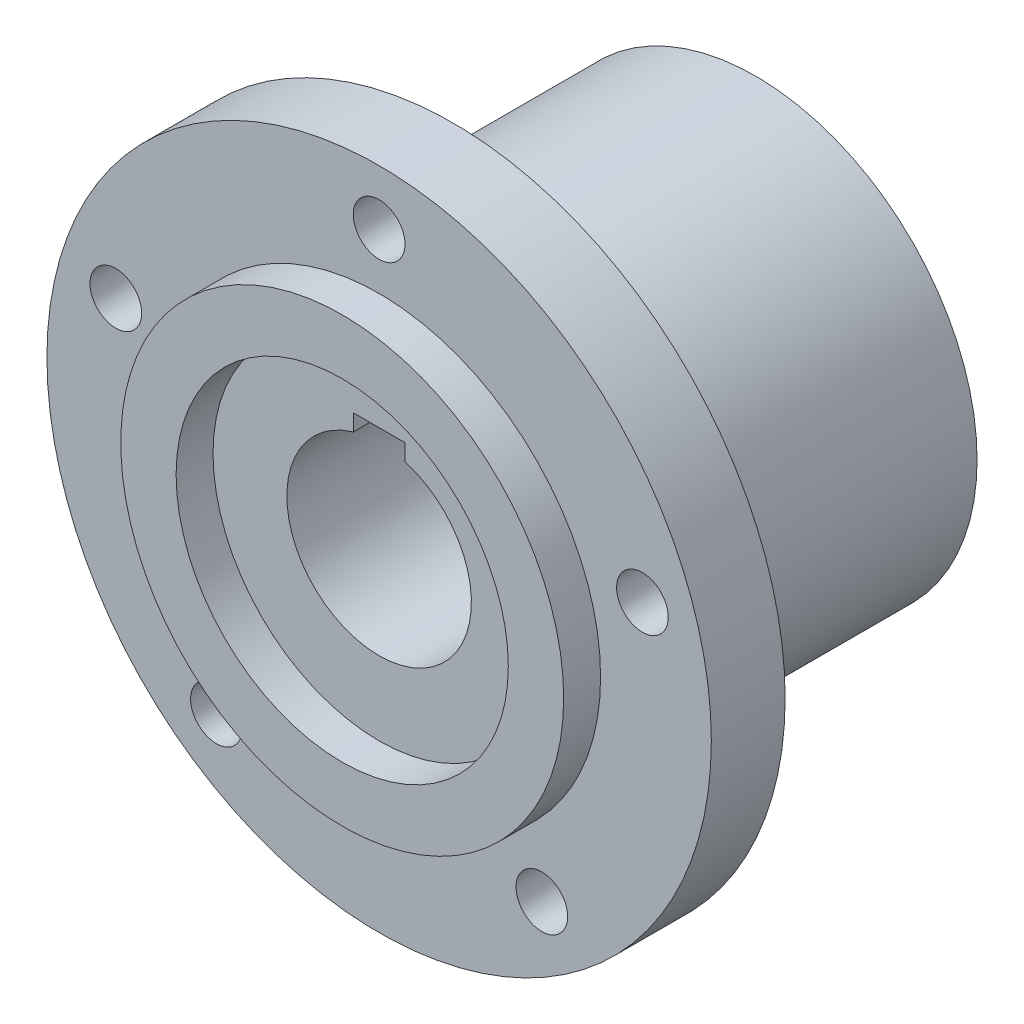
from build123d import *

# Parameters (mm, degrees)
ESQUISSE1_R                  = 60
EXTRUSION1_DEPTH             = 51
ENL_V_MAT_EXTRU_1_DEPTH      = 133.680066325
ESQUISSE3_R                  = 90
ESQUISSE3_R_2                = 60
EXTRUSION2_DEPTH             = 20
TROU_TARAUD_M16X2_D          = 14
R_P_TITION_CIRCULAIRE1_COUNT = 5
EXTRUSION3_START             = 10
ESQUISSE8_R                  = 60
ESQUISSE8_R_2                = 45
EXTRUSION3_DEPTH             = 10


with BuildPart() as part:
    # Esquisse1 → Extrusion1 (new, symmetric)
    with BuildSketch(Plane.XY):
        Circle(ESQUISSE1_R)
    extrude(amount=EXTRUSION1_DEPTH, both=True)

    # Esquisse2 → Enl_v. mat.-Extru.1 (cut, through all)
    with BuildSketch(Plane.XY.offset(51)):
        with BuildLine():
            Line((7, 28.5), (-7, 28.5))
            Line((-7, 28.5), (-7, 24))
            ThreePointArc((-7, 24), (0, -25), (7, 24))
            Line((7, 24), (7, 28.5))
        make_face()
    extrude(amount=-ENL_V_MAT_EXTRU_1_DEPTH, mode=Mode.SUBTRACT)

    # Esquisse3 → Extrusion2 (add)
    with BuildSketch(Plane.XY.offset(51)):
        Circle(ESQUISSE3_R)
        Circle(ESQUISSE3_R_2, mode=Mode.SUBTRACT)
    extrude(amount=-EXTRUSION2_DEPTH)

    # Trou taraud_ M16x2 (through all)
    with Locations(Plane.XY.offset(51)):
        with Locations((0, 75)):
            trou_taraud_m16x2 = Hole(TROU_TARAUD_M16X2_D / 2)

    # R_p_tition circulaire1: Trou taraud_ M16x2 ×5 about axis
    r_p_tition_circulaire1_axis = Axis((0, 0, 0), (0, 0, 1))
    for i in range(1, R_P_TITION_CIRCULAIRE1_COUNT):
        add(trou_taraud_m16x2.rotate(r_p_tition_circulaire1_axis, i * 360 / R_P_TITION_CIRCULAIRE1_COUNT), mode=Mode.SUBTRACT)

    # Esquisse8 → Extrusion3 (add)
    with BuildSketch(Plane.XY.offset(51).offset(EXTRUSION3_START)):
        Circle(ESQUISSE8_R)
        Circle(ESQUISSE8_R_2, mode=Mode.SUBTRACT)
    extrude(amount=-EXTRUSION3_DEPTH)


solid = part.part
